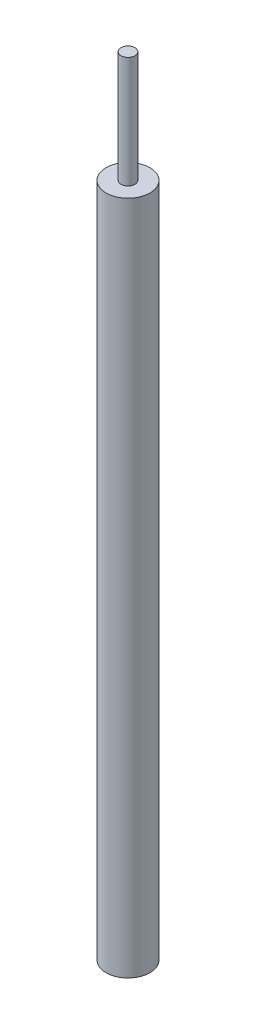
ISO-10303-21;
HEADER;
FILE_DESCRIPTION(('STEP AP214'),'2;1');
FILE_NAME('part.step','',(''),(''),'','','');
FILE_SCHEMA(('AUTOMOTIVE_DESIGN { 1 0 10303 214 1 1 1 1 }'));
ENDSEC;
DATA;
#1=APPLICATION_CONTEXT('core data for automotive mechanical design processes');
#2=APPLICATION_PROTOCOL_DEFINITION('international standard','automotive_design',2000,#1);
#3=PRODUCT_CONTEXT('',#1,'mechanical');
#4=PRODUCT('Part','Part','',(#3));
#5=PRODUCT_RELATED_PRODUCT_CATEGORY('part','',(#4));
#6=PRODUCT_DEFINITION_FORMATION('','',#4);
#7=PRODUCT_DEFINITION_CONTEXT('part definition',#1,'design');
#8=PRODUCT_DEFINITION('design','',#6,#7);
#9=PRODUCT_DEFINITION_SHAPE('','',#8);
#10=(LENGTH_UNIT() NAMED_UNIT(*) SI_UNIT(.MILLI.,.METRE.));
#11=(NAMED_UNIT(*) PLANE_ANGLE_UNIT() SI_UNIT($,.RADIAN.));
#12=(NAMED_UNIT(*) SI_UNIT($,.STERADIAN.) SOLID_ANGLE_UNIT());
#13=UNCERTAINTY_MEASURE_WITH_UNIT(LENGTH_MEASURE(1.E-05),#10,'distance_accuracy_value','');
#14=(GEOMETRIC_REPRESENTATION_CONTEXT(3) GLOBAL_UNCERTAINTY_ASSIGNED_CONTEXT((#13)) GLOBAL_UNIT_ASSIGNED_CONTEXT((#10,
#11,#12)) REPRESENTATION_CONTEXT('',''));
#15=CARTESIAN_POINT('',(0.,0.,0.));
#16=DIRECTION('',(0.,0.,1.));
#17=DIRECTION('',(1.,0.,0.));
#18=AXIS2_PLACEMENT_3D('',#15,#16,#17);
#19=CARTESIAN_POINT('',(0.,603.25,0.));
#20=DIRECTION('',(0.,-1.,0.));
#21=DIRECTION('',(0.,0.,-1.));
#22=AXIS2_PLACEMENT_3D('',#19,#20,#21);
#23=CYLINDRICAL_SURFACE('',#22,20.000000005);
#24=CARTESIAN_POINT('',(0.,0.,0.));
#25=DIRECTION('',(0.,1.,0.));
#26=DIRECTION('',(0.,0.,1.));
#27=AXIS2_PLACEMENT_3D('',#24,#25,#26);
#28=CIRCLE('',#27,20.000000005);
#29=CARTESIAN_POINT('',(0.,0.,20.000000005));
#30=VERTEX_POINT('',#29);
#31=EDGE_CURVE('E40',#30,#30,#28,.T.);
#32=ORIENTED_EDGE('',*,*,#31,.T.);
#33=EDGE_LOOP('',(#32));
#34=FACE_BOUND('',#33,.T.);
#35=CARTESIAN_POINT('',(0.,615.95,0.));
#36=DIRECTION('',(0.,1.,0.));
#37=DIRECTION('',(0.,0.,1.));
#38=AXIS2_PLACEMENT_3D('',#35,#36,#37);
#39=CIRCLE('',#38,20.000000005);
#40=CARTESIAN_POINT('',(0.,615.95,20.000000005));
#41=VERTEX_POINT('',#40);
#42=EDGE_CURVE('E52',#41,#41,#39,.T.);
#43=ORIENTED_EDGE('',*,*,#42,.F.);
#44=EDGE_LOOP('',(#43));
#45=FACE_BOUND('',#44,.T.);
#46=ADVANCED_FACE('F37',(#34,#45),#23,.T.);
#47=CARTESIAN_POINT('',(0.,0.,0.));
#48=DIRECTION('',(0.,1.,0.));
#49=DIRECTION('',(0.,0.,1.));
#50=AXIS2_PLACEMENT_3D('',#47,#48,#49);
#51=PLANE('',#50);
#52=CARTESIAN_POINT('',(1.24968,0.,0.));
#53=DIRECTION('',(0.,1.,0.));
#54=DIRECTION('',(0.,0.,1.));
#55=AXIS2_PLACEMENT_3D('',#52,#53,#54);
#56=CIRCLE('',#55,16.031467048);
#57=CARTESIAN_POINT('',(1.24968,0.,16.031467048));
#58=VERTEX_POINT('',#57);
#59=EDGE_CURVE('E48',#58,#58,#56,.T.);
#60=ORIENTED_EDGE('',*,*,#59,.T.);
#61=EDGE_LOOP('',(#60));
#62=FACE_BOUND('',#61,.T.);
#63=ORIENTED_EDGE('',*,*,#31,.F.);
#64=EDGE_LOOP('',(#63));
#65=FACE_BOUND('',#64,.T.);
#66=ADVANCED_FACE('F74',(#62,#65),#51,.F.);
#67=CARTESIAN_POINT('',(1.24968,0.,0.));
#68=DIRECTION('',(0.,1.,0.));
#69=DIRECTION('',(0.,0.,1.));
#70=AXIS2_PLACEMENT_3D('',#67,#68,#69);
#71=CYLINDRICAL_SURFACE('',#70,16.031467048);
#72=ORIENTED_EDGE('',*,*,#59,.F.);
#73=EDGE_LOOP('',(#72));
#74=FACE_BOUND('',#73,.T.);
#75=CARTESIAN_POINT('',(1.24968,603.25,0.));
#76=DIRECTION('',(0.,1.,0.));
#77=DIRECTION('',(0.,0.,1.));
#78=AXIS2_PLACEMENT_3D('',#75,#76,#77);
#79=CIRCLE('',#78,16.031467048);
#80=CARTESIAN_POINT('',(1.24968,603.25,16.031467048));
#81=VERTEX_POINT('',#80);
#82=EDGE_CURVE('E55',#81,#81,#79,.T.);
#83=ORIENTED_EDGE('',*,*,#82,.T.);
#84=EDGE_LOOP('',(#83));
#85=FACE_BOUND('',#84,.T.);
#86=ADVANCED_FACE('F60',(#74,#85),#71,.F.);
#87=CARTESIAN_POINT('',(0.,603.25,0.));
#88=DIRECTION('',(0.,1.,0.));
#89=DIRECTION('',(0.,0.,1.));
#90=AXIS2_PLACEMENT_3D('',#87,#88,#89);
#91=PLANE('',#90);
#92=ORIENTED_EDGE('',*,*,#82,.F.);
#93=EDGE_LOOP('',(#92));
#94=FACE_BOUND('',#93,.T.);
#95=ADVANCED_FACE('F62',(#94),#91,.F.);
#96=CARTESIAN_POINT('',(0.,615.95,0.));
#97=DIRECTION('',(0.,1.,0.));
#98=DIRECTION('',(0.,0.,1.));
#99=AXIS2_PLACEMENT_3D('',#96,#97,#98);
#100=PLANE('',#99);
#101=CARTESIAN_POINT('',(0.,615.95,0.));
#102=DIRECTION('',(0.,1.,0.));
#103=DIRECTION('',(0.,0.,1.));
#104=AXIS2_PLACEMENT_3D('',#101,#102,#103);
#105=CIRCLE('',#104,6.35);
#106=CARTESIAN_POINT('',(0.,615.95,6.35));
#107=VERTEX_POINT('',#106);
#108=EDGE_CURVE('E10',#107,#107,#105,.T.);
#109=ORIENTED_EDGE('',*,*,#108,.F.);
#110=EDGE_LOOP('',(#109));
#111=FACE_BOUND('',#110,.T.);
#112=ORIENTED_EDGE('',*,*,#42,.T.);
#113=EDGE_LOOP('',(#112));
#114=FACE_BOUND('',#113,.T.);
#115=ADVANCED_FACE('F64',(#111,#114),#100,.T.);
#116=CARTESIAN_POINT('',(0.,717.55,0.));
#117=DIRECTION('',(0.,-1.,0.));
#118=DIRECTION('',(0.,0.,-1.));
#119=AXIS2_PLACEMENT_3D('',#116,#117,#118);
#120=CYLINDRICAL_SURFACE('',#119,6.35);
#121=CARTESIAN_POINT('',(0.,717.55,0.));
#122=DIRECTION('',(0.,1.,0.));
#123=DIRECTION('',(0.,0.,1.));
#124=AXIS2_PLACEMENT_3D('',#121,#122,#123);
#125=CIRCLE('',#124,6.35);
#126=CARTESIAN_POINT('',(0.,717.55,6.35));
#127=VERTEX_POINT('',#126);
#128=EDGE_CURVE('E51',#127,#127,#125,.T.);
#129=ORIENTED_EDGE('',*,*,#128,.F.);
#130=EDGE_LOOP('',(#129));
#131=FACE_BOUND('',#130,.T.);
#132=ORIENTED_EDGE('',*,*,#108,.T.);
#133=EDGE_LOOP('',(#132));
#134=FACE_BOUND('',#133,.T.);
#135=ADVANCED_FACE('F70',(#131,#134),#120,.T.);
#136=CARTESIAN_POINT('',(0.,717.55,0.));
#137=DIRECTION('',(0.,1.,0.));
#138=DIRECTION('',(0.,0.,1.));
#139=AXIS2_PLACEMENT_3D('',#136,#137,#138);
#140=PLANE('',#139);
#141=ORIENTED_EDGE('',*,*,#128,.T.);
#142=EDGE_LOOP('',(#141));
#143=FACE_BOUND('',#142,.T.);
#144=ADVANCED_FACE('F121',(#143),#140,.T.);
#145=CLOSED_SHELL('',(#46,#66,#86,#95,#115,#135,#144));
#146=MANIFOLD_SOLID_BREP('B2',#145);
#147=ADVANCED_BREP_SHAPE_REPRESENTATION('',(#18,#146),#14);
#148=SHAPE_DEFINITION_REPRESENTATION(#9,#147);
ENDSEC;
END-ISO-10303-21;
